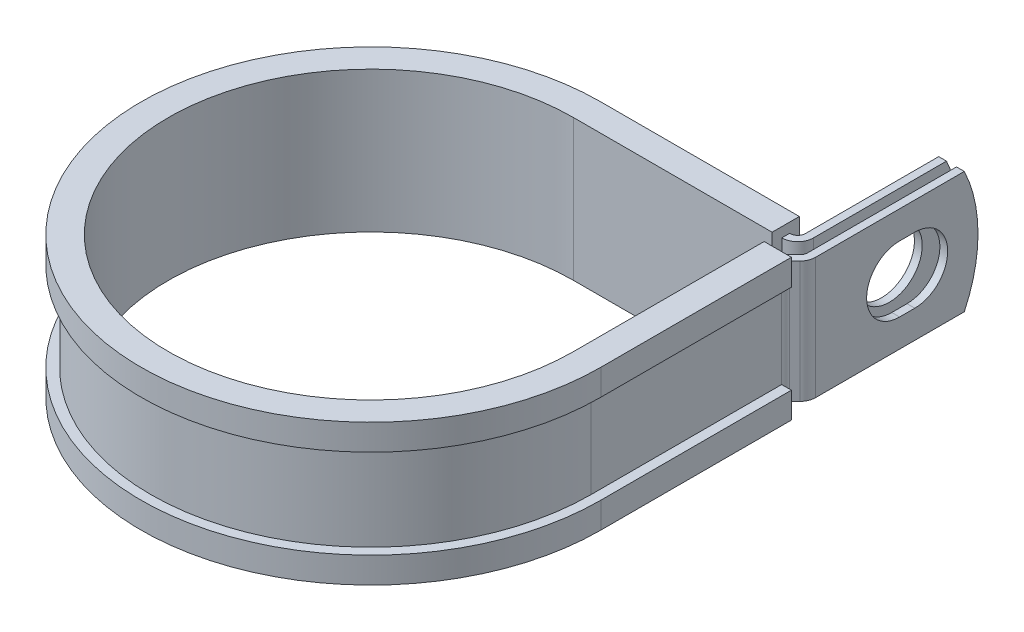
from build123d import *

# Parameters (mm, degrees)
EXTRUDE_THIN1_DEPTH = 9.525
SKETCH2_R           = 5.1562
CUT_EXTRUDE1_DEPTH  = 1.2192
CUT_EXTRUDE2_DEPTH  = 1.2192
CUT_EXTRUDE3_DEPTH  = 90.504269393


with BuildPart() as part:
    # Sketch1 → Extrude-Thin1 (new, symmetric)
    with BuildSketch(Plane(origin=(0, 0, 0), x_dir=(1, 0, 0), z_dir=(0, 1, 0))):
        with BuildLine():
            Line((35.1714698, 58.7248), (35.1714698, 33.274))
            ThreePointArc((35.1714698, 33.274), (35.078663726, 32.807432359), (34.814374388, 32.411895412))
            Line((34.814374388, 32.411895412), (33.988190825, 31.585711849))
            ThreePointArc((33.988190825, 31.585711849), (33.459612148, 30.794637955), (33.274, 29.861502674))
            Line((33.274, 29.861502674), (33.274, 0))
            ThreePointArc((33.274, 0), (-23.528271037, -23.528271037), (0, 33.274))
            Line((0, 33.274), (31.1582698, 33.274))
            ThreePointArc((31.1582698, 33.274), (32.882478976, 33.988190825), (33.5966698, 35.7124))
            Line((33.5966698, 35.7124), (33.5966698, 58.7248))
            Line((33.5966698, 58.7248), (32.3774698, 58.7248))
            Line((32.3774698, 58.7248), (32.3774698, 35.7124))
            ThreePointArc((32.3774698, 35.7124), (32.020374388, 34.850295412), (31.1582698, 34.4932))
            Line((31.1582698, 34.4932), (0, 34.4932))
            ThreePointArc((0, 34.4932), (-24.390375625, -24.390375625), (34.4932, 0))
            Line((34.4932, 0), (34.4932, 29.861502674))
            ThreePointArc((34.4932, 29.861502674), (34.586006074, 30.328070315), (34.850295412, 30.723607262))
            Line((34.850295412, 30.723607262), (35.676478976, 31.549790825))
            ThreePointArc((35.676478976, 31.549790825), (36.205057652, 32.340864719), (36.3906698, 33.274))
            Line((36.3906698, 33.274), (36.3906698, 58.7248))
            Line((36.3906698, 58.7248), (35.1714698, 58.7248))
        make_face()
    extrude(amount=EXTRUDE_THIN1_DEPTH, both=True)

    # Sketch2 → Cut-Extrude1 (cut)
    with BuildSketch(Plane.ZY.offset(-32.3774698)):
        with Locations((-47.625, 0)):
            Circle(SKETCH2_R)
    extrude(amount=-CUT_EXTRUDE1_DEPTH, mode=Mode.SUBTRACT)

    # Sketch3 → Cut-Extrude2 (cut)
    with BuildSketch(Plane(origin=(36.3906698, 0, 0), x_dir=(0, 0, -1), z_dir=(1, 0, 0))):
        with BuildLine():
            Line((46.4312, 5.1562), (48.8188, 5.1562))
            ThreePointArc((48.8188, 5.1562), (53.975, 0), (48.8188, -5.1562))
            Line((48.8188, -5.1562), (46.4312, -5.1562))
            ThreePointArc((46.4312, -5.1562), (41.275, 0), (46.4312, 5.1562))
        make_face()
    extrude(amount=-CUT_EXTRUDE2_DEPTH, mode=Mode.SUBTRACT)

    # Sketch4 → Cut-Extrude3 (cut, through all)
    with BuildSketch(Plane.ZY.offset(-32.3774698)):
        with BuildLine():
            Line((-56.580263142, 9.525), (-58.7248, 9.525))
            Line((-58.7248, 9.525), (-58.7248, 0))
            ThreePointArc((-58.7248, 0), (-58.182038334, 4.881717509), (-56.580263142, 9.525))
        make_face()
        with BuildLine():
            ThreePointArc((-56.580263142, -9.525), (-58.182038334, -4.881717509), (-58.7248, 0))
            Line((-58.7248, 0), (-58.7248, -9.525))
            Line((-58.7248, -9.525), (-56.580263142, -9.525))
        make_face()
    extrude(amount=-CUT_EXTRUDE3_DEPTH, mode=Mode.SUBTRACT)

    # Sweep1: sweep along a path in Sketch6
    with BuildLine(Plane(origin=(0, 9.525, 0), x_dir=(1, 0, 0), z_dir=(0, 1, 0))) as sweep1_path:
        Line((31.75, 29.861502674), (31.75, 0))
        ThreePointArc((31.75, 0), (-22.450640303, -22.450640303), (0, 31.75))
        Line((0, 31.75), (31.1074698, 31.75))
    # Sketch5 → Sweep1 (sweep)
    with BuildSketch(Plane(origin=(0, 0, -29.861502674), x_dir=(-1, 0, 0), z_dir=(0, 0, -1))):
        Polygon((-34.4932, 9.525), (-33.274, 9.525), (-33.274, -9.525), (-34.4932, -9.525), (-34.4932, -6.985), (-36.0172, -6.985), (-36.0172, -11.049), (-31.75, -11.049), (-31.75, 11.049), (-36.0172, 11.049), (-36.0172, 6.985), (-34.4932, 6.985), align=None)
    sweep(path=sweep1_path.line)


solid = part.part
